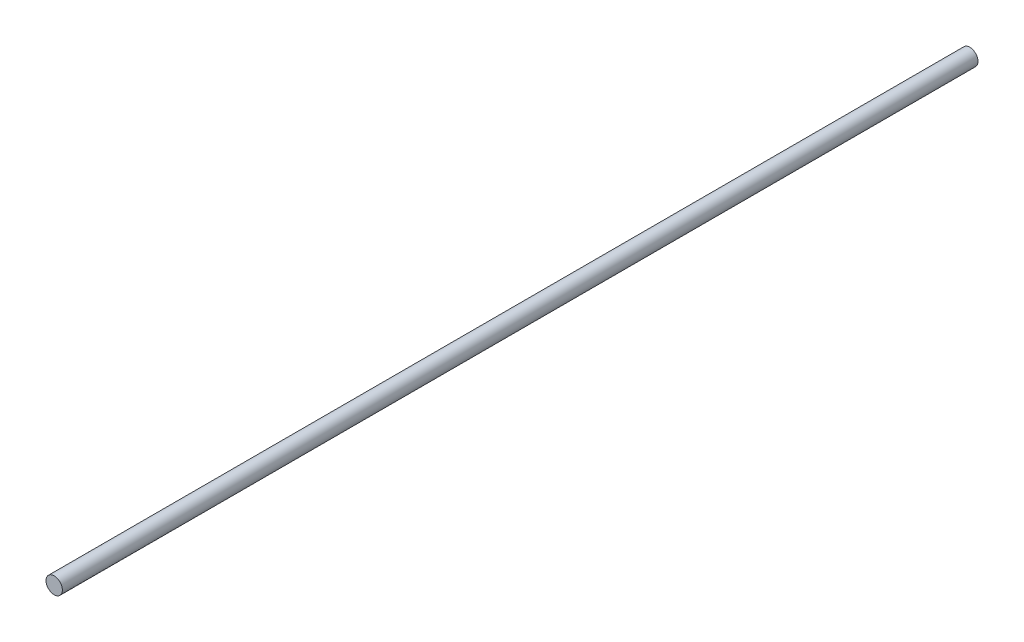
from build123d import *

# Parameters (mm, degrees)
SKETCH1_R           = 30
BOSS_EXTRUDE1_DEPTH = 3350


with BuildPart() as part:
    # Sketch1 → Boss-Extrude1 (new body)
    with BuildSketch(Plane.XY):
        Circle(SKETCH1_R)
    extrude(amount=-BOSS_EXTRUDE1_DEPTH)


solid = part.part
